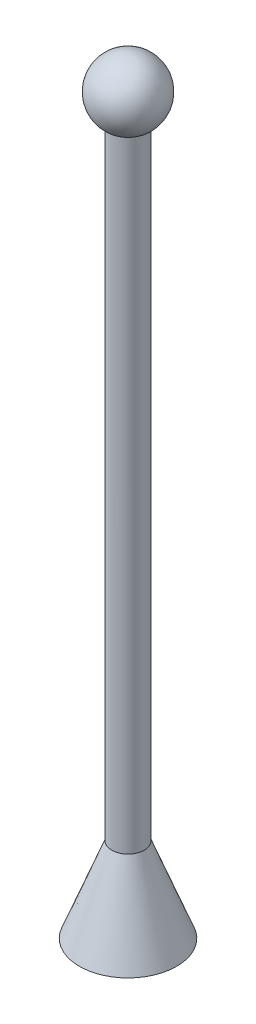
ISO-10303-21;
HEADER;
FILE_DESCRIPTION(('STEP AP214'),'2;1');
FILE_NAME('part.step','',(''),(''),'','','');
FILE_SCHEMA(('AUTOMOTIVE_DESIGN { 1 0 10303 214 1 1 1 1 }'));
ENDSEC;
DATA;
#1=APPLICATION_CONTEXT('core data for automotive mechanical design processes');
#2=APPLICATION_PROTOCOL_DEFINITION('international standard','automotive_design',2000,#1);
#3=PRODUCT_CONTEXT('',#1,'mechanical');
#4=PRODUCT('Part','Part','',(#3));
#5=PRODUCT_RELATED_PRODUCT_CATEGORY('part','',(#4));
#6=PRODUCT_DEFINITION_FORMATION('','',#4);
#7=PRODUCT_DEFINITION_CONTEXT('part definition',#1,'design');
#8=PRODUCT_DEFINITION('design','',#6,#7);
#9=PRODUCT_DEFINITION_SHAPE('','',#8);
#10=(LENGTH_UNIT() NAMED_UNIT(*) SI_UNIT(.MILLI.,.METRE.));
#11=(NAMED_UNIT(*) PLANE_ANGLE_UNIT() SI_UNIT($,.RADIAN.));
#12=(NAMED_UNIT(*) SI_UNIT($,.STERADIAN.) SOLID_ANGLE_UNIT());
#13=UNCERTAINTY_MEASURE_WITH_UNIT(LENGTH_MEASURE(1.E-05),#10,'distance_accuracy_value','');
#14=(GEOMETRIC_REPRESENTATION_CONTEXT(3) GLOBAL_UNCERTAINTY_ASSIGNED_CONTEXT((#13)) GLOBAL_UNIT_ASSIGNED_CONTEXT((#10,
#11,#12)) REPRESENTATION_CONTEXT('',''));
#15=CARTESIAN_POINT('',(0.,0.,0.));
#16=DIRECTION('',(0.,0.,1.));
#17=DIRECTION('',(1.,0.,0.));
#18=AXIS2_PLACEMENT_3D('',#15,#16,#17);
#19=CARTESIAN_POINT('',(0.,0.,0.));
#20=DIRECTION('',(0.,1.,0.));
#21=DIRECTION('',(0.,0.,1.));
#22=AXIS2_PLACEMENT_3D('',#19,#20,#21);
#23=PLANE('',#22);
#24=CARTESIAN_POINT('',(0.,0.,0.));
#25=DIRECTION('',(0.,1.,0.));
#26=DIRECTION('',(0.,0.,1.));
#27=AXIS2_PLACEMENT_3D('',#24,#25,#26);
#28=CIRCLE('',#27,19.05);
#29=CARTESIAN_POINT('',(0.,0.,-19.05));
#30=VERTEX_POINT('',#29);
#31=EDGE_CURVE('E41',#30,#30,#28,.T.);
#32=ORIENTED_EDGE('',*,*,#31,.F.);
#33=EDGE_LOOP('',(#32));
#34=FACE_BOUND('',#33,.T.);
#35=ADVANCED_FACE('F33',(#34),#23,.F.);
#36=CARTESIAN_POINT('',(0.,33.02,0.));
#37=DIRECTION('',(0.,-1.,0.));
#38=DIRECTION('',(0.,0.,-1.));
#39=AXIS2_PLACEMENT_3D('',#36,#37,#38);
#40=CONICAL_SURFACE('',#39,6.35,0.367173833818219);
#41=CARTESIAN_POINT('',(0.,33.02,0.));
#42=DIRECTION('',(0.,1.,0.));
#43=DIRECTION('',(0.,0.,1.));
#44=AXIS2_PLACEMENT_3D('',#41,#42,#43);
#45=CIRCLE('',#44,6.35);
#46=CARTESIAN_POINT('',(0.,33.02,-6.35));
#47=VERTEX_POINT('',#46);
#48=EDGE_CURVE('E11',#47,#47,#45,.T.);
#49=CARTESIAN_POINT('',(0.,33.02,-6.35));
#50=CARTESIAN_POINT('',(0.,32.6760416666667,-6.48229166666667));
#51=CARTESIAN_POINT('',(0.,32.3320833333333,-6.61458333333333));
#52=CARTESIAN_POINT('',(0.,31.6441666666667,-6.87916666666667));
#53=CARTESIAN_POINT('',(0.,31.3002083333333,-7.01145833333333));
#54=CARTESIAN_POINT('',(0.,30.6122916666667,-7.27604166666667));
#55=CARTESIAN_POINT('',(0.,30.2683333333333,-7.40833333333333));
#56=CARTESIAN_POINT('',(0.,29.5804166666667,-7.67291666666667));
#57=CARTESIAN_POINT('',(0.,29.2364583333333,-7.80520833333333));
#58=CARTESIAN_POINT('',(0.,28.5485416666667,-8.06979166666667));
#59=CARTESIAN_POINT('',(0.,28.2045833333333,-8.20208333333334));
#60=CARTESIAN_POINT('',(0.,27.5166666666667,-8.46666666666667));
#61=CARTESIAN_POINT('',(0.,27.1727083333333,-8.59895833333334));
#62=CARTESIAN_POINT('',(0.,26.4847916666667,-8.86354166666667));
#63=CARTESIAN_POINT('',(0.,26.1408333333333,-8.99583333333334));
#64=CARTESIAN_POINT('',(0.,25.4529166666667,-9.26041666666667));
#65=CARTESIAN_POINT('',(0.,25.1089583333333,-9.39270833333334));
#66=CARTESIAN_POINT('',(0.,24.4210416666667,-9.65729166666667));
#67=CARTESIAN_POINT('',(0.,24.0770833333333,-9.78958333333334));
#68=CARTESIAN_POINT('',(0.,23.3891666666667,-10.0541666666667));
#69=CARTESIAN_POINT('',(0.,23.0452083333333,-10.1864583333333));
#70=CARTESIAN_POINT('',(0.,22.3572916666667,-10.4510416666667));
#71=CARTESIAN_POINT('',(0.,22.0133333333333,-10.5833333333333));
#72=CARTESIAN_POINT('',(0.,21.3254166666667,-10.8479166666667));
#73=CARTESIAN_POINT('',(0.,20.9814583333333,-10.9802083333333));
#74=CARTESIAN_POINT('',(0.,20.2935416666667,-11.2447916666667));
#75=CARTESIAN_POINT('',(0.,19.9495833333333,-11.3770833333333));
#76=CARTESIAN_POINT('',(0.,19.2616666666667,-11.6416666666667));
#77=CARTESIAN_POINT('',(0.,18.9177083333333,-11.7739583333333));
#78=CARTESIAN_POINT('',(0.,18.2297916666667,-12.0385416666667));
#79=CARTESIAN_POINT('',(0.,17.8858333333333,-12.1708333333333));
#80=CARTESIAN_POINT('',(0.,17.1979166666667,-12.4354166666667));
#81=CARTESIAN_POINT('',(0.,16.8539583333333,-12.5677083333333));
#82=CARTESIAN_POINT('',(0.,16.1660416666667,-12.8322916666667));
#83=CARTESIAN_POINT('',(0.,15.8220833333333,-12.9645833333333));
#84=CARTESIAN_POINT('',(0.,15.1341666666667,-13.2291666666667));
#85=CARTESIAN_POINT('',(0.,14.7902083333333,-13.3614583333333));
#86=CARTESIAN_POINT('',(0.,14.1022916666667,-13.6260416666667));
#87=CARTESIAN_POINT('',(0.,13.7583333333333,-13.7583333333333));
#88=CARTESIAN_POINT('',(0.,13.0704166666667,-14.0229166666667));
#89=CARTESIAN_POINT('',(0.,12.7264583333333,-14.1552083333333));
#90=CARTESIAN_POINT('',(0.,12.0385416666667,-14.4197916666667));
#91=CARTESIAN_POINT('',(0.,11.6945833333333,-14.5520833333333));
#92=CARTESIAN_POINT('',(0.,11.0066666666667,-14.8166666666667));
#93=CARTESIAN_POINT('',(0.,10.6627083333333,-14.9489583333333));
#94=CARTESIAN_POINT('',(0.,9.97479166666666,-15.2135416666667));
#95=CARTESIAN_POINT('',(0.,9.63083333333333,-15.3458333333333));
#96=CARTESIAN_POINT('',(0.,8.94291666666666,-15.6104166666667));
#97=CARTESIAN_POINT('',(0.,8.59895833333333,-15.7427083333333));
#98=CARTESIAN_POINT('',(0.,7.91104166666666,-16.0072916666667));
#99=CARTESIAN_POINT('',(0.,7.56708333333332,-16.1395833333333));
#100=CARTESIAN_POINT('',(0.,6.87916666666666,-16.4041666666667));
#101=CARTESIAN_POINT('',(0.,6.53520833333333,-16.5364583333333));
#102=CARTESIAN_POINT('',(0.,5.84729166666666,-16.8010416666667));
#103=CARTESIAN_POINT('',(0.,5.50333333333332,-16.9333333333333));
#104=CARTESIAN_POINT('',(0.,4.81541666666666,-17.1979166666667));
#105=CARTESIAN_POINT('',(0.,4.47145833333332,-17.3302083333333));
#106=CARTESIAN_POINT('',(0.,3.78354166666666,-17.5947916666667));
#107=CARTESIAN_POINT('',(0.,3.43958333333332,-17.7270833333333));
#108=CARTESIAN_POINT('',(0.,2.75166666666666,-17.9916666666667));
#109=CARTESIAN_POINT('',(0.,2.40770833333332,-18.1239583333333));
#110=CARTESIAN_POINT('',(0.,1.71979166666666,-18.3885416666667));
#111=CARTESIAN_POINT('',(0.,1.37583333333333,-18.5208333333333));
#112=CARTESIAN_POINT('',(0.,0.687916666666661,-18.7854166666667));
#113=CARTESIAN_POINT('',(0.,0.343958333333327,-18.9177083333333));
#114=CARTESIAN_POINT('',(0.,0.,-19.05));
#115=B_SPLINE_CURVE_WITH_KNOTS('',3,(#49,#50,#51,#52,#53,#54,#55,#56,#57,#58,#59,#60,#61,#62,
#63,#64,#65,#66,#67,#68,#69,#70,#71,#72,#73,#74,#75,#76,#77,#78,#79,#80,#81,#82,#83,#84,#85,#86,
#87,#88,#89,#90,#91,#92,#93,#94,#95,#96,#97,#98,#99,#100,#101,#102,#103,#104,#105,#106,#107,
#108,#109,#110,#111,#112,#113,#114),.UNSPECIFIED.,.F.,.F.,(4,2,2,2,2,2,2,2,2,2,2,2,2,2,2,2,2,2,
2,2,2,2,2,2,2,2,2,2,2,2,2,2,4),(0.,1.10556581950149,2.21113163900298,3.31669745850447,
4.42226327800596,5.52782909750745,6.63339491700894,7.73896073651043,8.84452655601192,
9.95009237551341,11.0556581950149,12.1612240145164,13.2667898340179,14.3723556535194,
15.4779214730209,16.5834872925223,17.6890531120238,18.7946189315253,19.9001847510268,
21.0057505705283,22.1113163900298,23.2168822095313,24.3224480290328,25.4280138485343,
26.5335796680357,27.6391454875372,28.7447113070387,29.8502771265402,30.9558429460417,
32.0614087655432,33.1669745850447,34.2725404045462,35.3781062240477),.UNSPECIFIED.);
#116=EDGE_CURVE('BSEAM71',#47,#30,#115,.T.);
#117=ORIENTED_EDGE('',*,*,#48,.F.);
#118=ORIENTED_EDGE('',*,*,#31,.T.);
#119=ORIENTED_EDGE('',*,*,#116,.T.);
#120=ORIENTED_EDGE('',*,*,#116,.F.);
#121=EDGE_LOOP('',(#117,#119,#118,#120));
#122=FACE_BOUND('',#121,.T.);
#123=ADVANCED_FACE('F71',(#122),#40,.T.);
#124=CARTESIAN_POINT('',(0.,287.02,0.));
#125=DIRECTION('',(0.,-1.,0.));
#126=DIRECTION('',(0.,0.,-1.));
#127=AXIS2_PLACEMENT_3D('',#124,#125,#126);
#128=CYLINDRICAL_SURFACE('',#127,6.35);
#129=CARTESIAN_POINT('',(0.,276.021477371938,0.));
#130=DIRECTION('',(0.,0.999999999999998,0.));
#131=DIRECTION('',(0.,0.,1.));
#132=AXIS2_PLACEMENT_3D('',#129,#130,#131);
#133=CIRCLE('',#132,6.35);
#134=CARTESIAN_POINT('',(0.,276.021477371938,6.35));
#135=VERTEX_POINT('',#134);
#136=EDGE_CURVE('E37',#135,#135,#133,.F.);
#137=ORIENTED_EDGE('',*,*,#136,.T.);
#138=EDGE_LOOP('',(#137));
#139=FACE_BOUND('',#138,.T.);
#140=ORIENTED_EDGE('',*,*,#48,.T.);
#141=EDGE_LOOP('',(#140));
#142=FACE_BOUND('',#141,.T.);
#143=ADVANCED_FACE('F83',(#139,#142),#128,.T.);
#144=CARTESIAN_POINT('',(0.,287.02,0.));
#145=DIRECTION('',(0.,1.,0.));
#146=DIRECTION('',(1.,0.,0.));
#147=AXIS2_PLACEMENT_3D('',#144,#145,#146);
#148=SPHERICAL_SURFACE('',#147,12.7);
#149=ORIENTED_EDGE('',*,*,#136,.F.);
#150=EDGE_LOOP('',(#149));
#151=FACE_BOUND('',#150,.T.);
#152=ADVANCED_FACE('F89',(#151),#148,.T.);
#153=CLOSED_SHELL('',(#35,#123,#143,#152));
#154=MANIFOLD_SOLID_BREP('B2',#153);
#155=ADVANCED_BREP_SHAPE_REPRESENTATION('',(#18,#154),#14);
#156=SHAPE_DEFINITION_REPRESENTATION(#9,#155);
ENDSEC;
END-ISO-10303-21;
